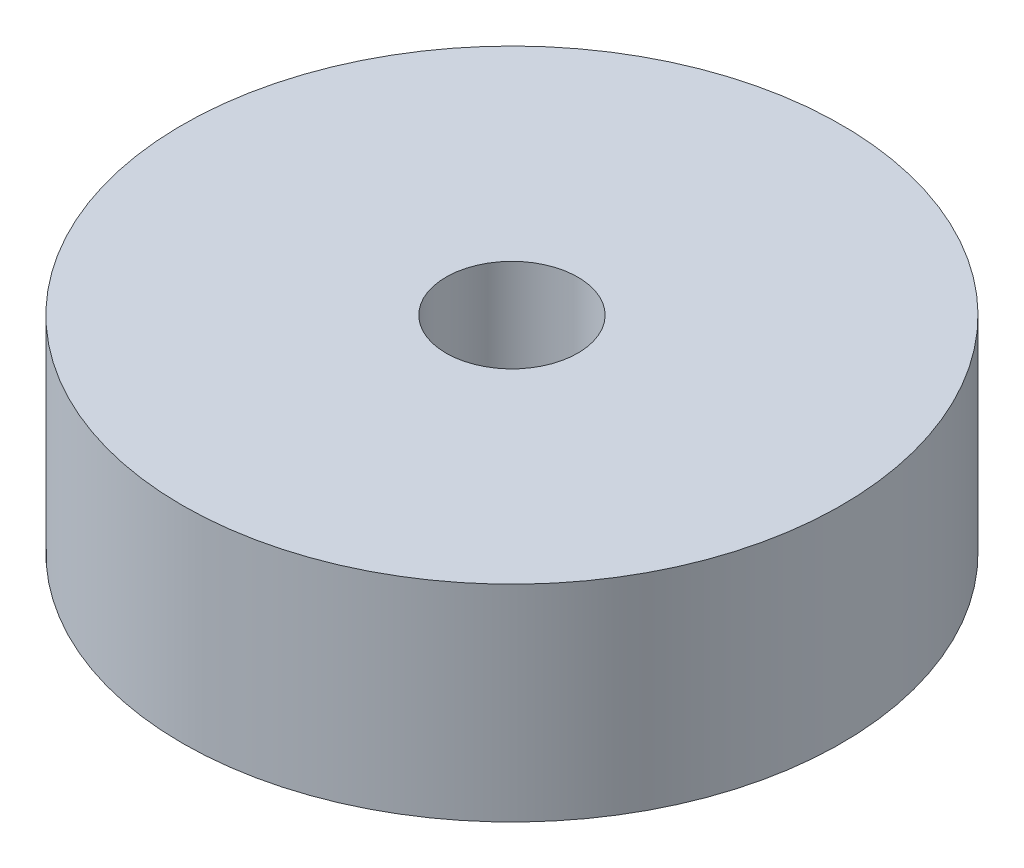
ISO-10303-21;
HEADER;
FILE_DESCRIPTION(('STEP AP214'),'2;1');
FILE_NAME('part.step','',(''),(''),'','','');
FILE_SCHEMA(('AUTOMOTIVE_DESIGN { 1 0 10303 214 1 1 1 1 }'));
ENDSEC;
DATA;
#1=APPLICATION_CONTEXT('core data for automotive mechanical design processes');
#2=APPLICATION_PROTOCOL_DEFINITION('international standard','automotive_design',2000,#1);
#3=PRODUCT_CONTEXT('',#1,'mechanical');
#4=PRODUCT('Part','Part','',(#3));
#5=PRODUCT_RELATED_PRODUCT_CATEGORY('part','',(#4));
#6=PRODUCT_DEFINITION_FORMATION('','',#4);
#7=PRODUCT_DEFINITION_CONTEXT('part definition',#1,'design');
#8=PRODUCT_DEFINITION('design','',#6,#7);
#9=PRODUCT_DEFINITION_SHAPE('','',#8);
#10=(LENGTH_UNIT() NAMED_UNIT(*) SI_UNIT(.MILLI.,.METRE.));
#11=(NAMED_UNIT(*) PLANE_ANGLE_UNIT() SI_UNIT($,.RADIAN.));
#12=(NAMED_UNIT(*) SI_UNIT($,.STERADIAN.) SOLID_ANGLE_UNIT());
#13=UNCERTAINTY_MEASURE_WITH_UNIT(LENGTH_MEASURE(1.E-05),#10,'distance_accuracy_value','');
#14=(GEOMETRIC_REPRESENTATION_CONTEXT(3) GLOBAL_UNCERTAINTY_ASSIGNED_CONTEXT((#13)) GLOBAL_UNIT_ASSIGNED_CONTEXT((#10,
#11,#12)) REPRESENTATION_CONTEXT('',''));
#15=CARTESIAN_POINT('',(0.,0.,0.));
#16=DIRECTION('',(0.,0.,1.));
#17=DIRECTION('',(1.,0.,0.));
#18=AXIS2_PLACEMENT_3D('',#15,#16,#17);
#19=CARTESIAN_POINT('',(0.,5.,0.));
#20=DIRECTION('',(0.,1.,0.));
#21=DIRECTION('',(0.,0.,1.));
#22=AXIS2_PLACEMENT_3D('',#19,#20,#21);
#23=PLANE('',#22);
#24=CARTESIAN_POINT('',(0.,5.,0.));
#25=DIRECTION('',(0.,1.,0.));
#26=DIRECTION('',(0.,0.,1.));
#27=AXIS2_PLACEMENT_3D('',#24,#25,#26);
#28=CIRCLE('',#27,8.);
#29=CARTESIAN_POINT('',(0.,5.,8.));
#30=VERTEX_POINT('',#29);
#31=EDGE_CURVE('E10',#30,#30,#28,.T.);
#32=ORIENTED_EDGE('',*,*,#31,.T.);
#33=EDGE_LOOP('',(#32));
#34=FACE_BOUND('',#33,.T.);
#35=CARTESIAN_POINT('',(0.,5.,0.));
#36=DIRECTION('',(0.,1.,0.));
#37=DIRECTION('',(0.,0.,1.));
#38=AXIS2_PLACEMENT_3D('',#35,#36,#37);
#39=CIRCLE('',#38,1.6);
#40=CARTESIAN_POINT('',(0.,5.,1.6));
#41=VERTEX_POINT('',#40);
#42=EDGE_CURVE('E47',#41,#41,#39,.T.);
#43=ORIENTED_EDGE('',*,*,#42,.F.);
#44=EDGE_LOOP('',(#43));
#45=FACE_BOUND('',#44,.T.);
#46=ADVANCED_FACE('F36',(#34,#45),#23,.T.);
#47=CARTESIAN_POINT('',(0.,0.,0.));
#48=DIRECTION('',(0.,1.,0.));
#49=DIRECTION('',(0.,0.,1.));
#50=AXIS2_PLACEMENT_3D('',#47,#48,#49);
#51=PLANE('',#50);
#52=CARTESIAN_POINT('',(0.,0.,0.));
#53=DIRECTION('',(0.,1.,0.));
#54=DIRECTION('',(0.,0.,1.));
#55=AXIS2_PLACEMENT_3D('',#52,#53,#54);
#56=CIRCLE('',#55,8.);
#57=CARTESIAN_POINT('',(0.,0.,8.));
#58=VERTEX_POINT('',#57);
#59=EDGE_CURVE('E40',#58,#58,#56,.T.);
#60=ORIENTED_EDGE('',*,*,#59,.F.);
#61=EDGE_LOOP('',(#60));
#62=FACE_BOUND('',#61,.T.);
#63=CARTESIAN_POINT('',(0.,0.,0.));
#64=DIRECTION('',(0.,1.,0.));
#65=DIRECTION('',(0.,0.,1.));
#66=AXIS2_PLACEMENT_3D('',#63,#64,#65);
#67=CIRCLE('',#66,1.6);
#68=CARTESIAN_POINT('',(0.,0.,1.6));
#69=VERTEX_POINT('',#68);
#70=EDGE_CURVE('E49',#69,#69,#67,.T.);
#71=ORIENTED_EDGE('',*,*,#70,.T.);
#72=EDGE_LOOP('',(#71));
#73=FACE_BOUND('',#72,.T.);
#74=ADVANCED_FACE('F59',(#62,#73),#51,.F.);
#75=CARTESIAN_POINT('',(0.,5.,0.));
#76=DIRECTION('',(0.,-1.,0.));
#77=DIRECTION('',(0.,0.,-1.));
#78=AXIS2_PLACEMENT_3D('',#75,#76,#77);
#79=CYLINDRICAL_SURFACE('',#78,8.);
#80=ORIENTED_EDGE('',*,*,#31,.F.);
#81=EDGE_LOOP('',(#80));
#82=FACE_BOUND('',#81,.T.);
#83=ORIENTED_EDGE('',*,*,#59,.T.);
#84=EDGE_LOOP('',(#83));
#85=FACE_BOUND('',#84,.T.);
#86=ADVANCED_FACE('F38',(#82,#85),#79,.T.);
#87=CARTESIAN_POINT('',(0.,5.,0.));
#88=DIRECTION('',(0.,-1.,0.));
#89=DIRECTION('',(0.,0.,-1.));
#90=AXIS2_PLACEMENT_3D('',#87,#88,#89);
#91=CYLINDRICAL_SURFACE('',#90,1.6);
#92=ORIENTED_EDGE('',*,*,#42,.T.);
#93=EDGE_LOOP('',(#92));
#94=FACE_BOUND('',#93,.T.);
#95=ORIENTED_EDGE('',*,*,#70,.F.);
#96=EDGE_LOOP('',(#95));
#97=FACE_BOUND('',#96,.T.);
#98=ADVANCED_FACE('F55',(#94,#97),#91,.F.);
#99=CLOSED_SHELL('',(#46,#74,#86,#98));
#100=MANIFOLD_SOLID_BREP('B2',#99);
#101=ADVANCED_BREP_SHAPE_REPRESENTATION('',(#18,#100),#14);
#102=SHAPE_DEFINITION_REPRESENTATION(#9,#101);
ENDSEC;
END-ISO-10303-21;
